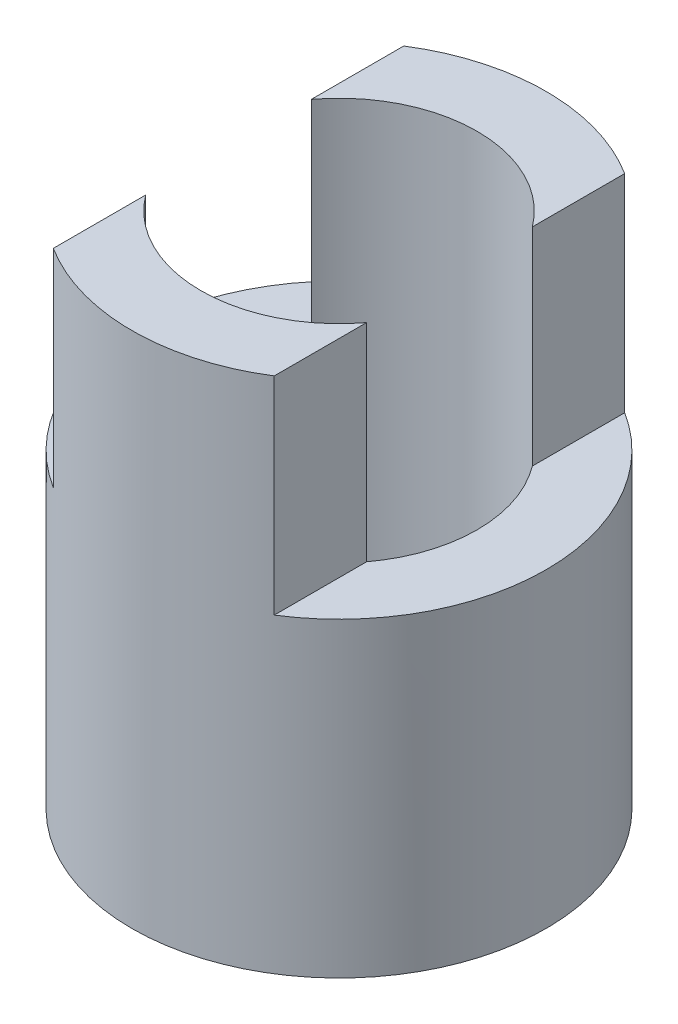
from build123d import *

# Parameters (mm, degrees)
SKETCH_1_R          = 30
SKETCH_1_R_2        = 20
EXTRUDE_1_DEPTH     = 75
CUT_EXTRUDE_START   = -30
CUT_EXTRUDE_1_DEPTH = 30


with BuildPart() as part:
    # Sketch 1 → Extrude 1 (new body)
    with BuildSketch(Plane(origin=(0, 0, 0), x_dir=(1, 0, 0), z_dir=(0, 1, 0))):
        with Locations(Location((0, 0, 0), (0, 0, 270))):
            Circle(SKETCH_1_R)
        with Locations(Location((0, 0, 0), (0, 0, 270))):
            Circle(SKETCH_1_R_2, mode=Mode.SUBTRACT)
    extrude(amount=EXTRUDE_1_DEPTH)

    # Sketch 2 → Cut-Extrude 1 (cut)
    with BuildSketch(Plane(origin=(0, 75, 0), x_dir=(1, 0, 0), z_dir=(0, 1, 0)).offset(CUT_EXTRUDE_START)):
        with BuildLine():
            Line((-16, -25.377155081), (-16, 25.377155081))
            ThreePointArc((-16, 25.377155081), (-30, 0), (-16, -25.377155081))
        make_face()
        with BuildLine():
            Line((16, 25.377155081), (16, -25.377155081))
            ThreePointArc((16, -25.377155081), (30, 0), (16, 25.377155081))
        make_face()
    extrude(amount=CUT_EXTRUDE_1_DEPTH, mode=Mode.SUBTRACT)


solid = part.part
